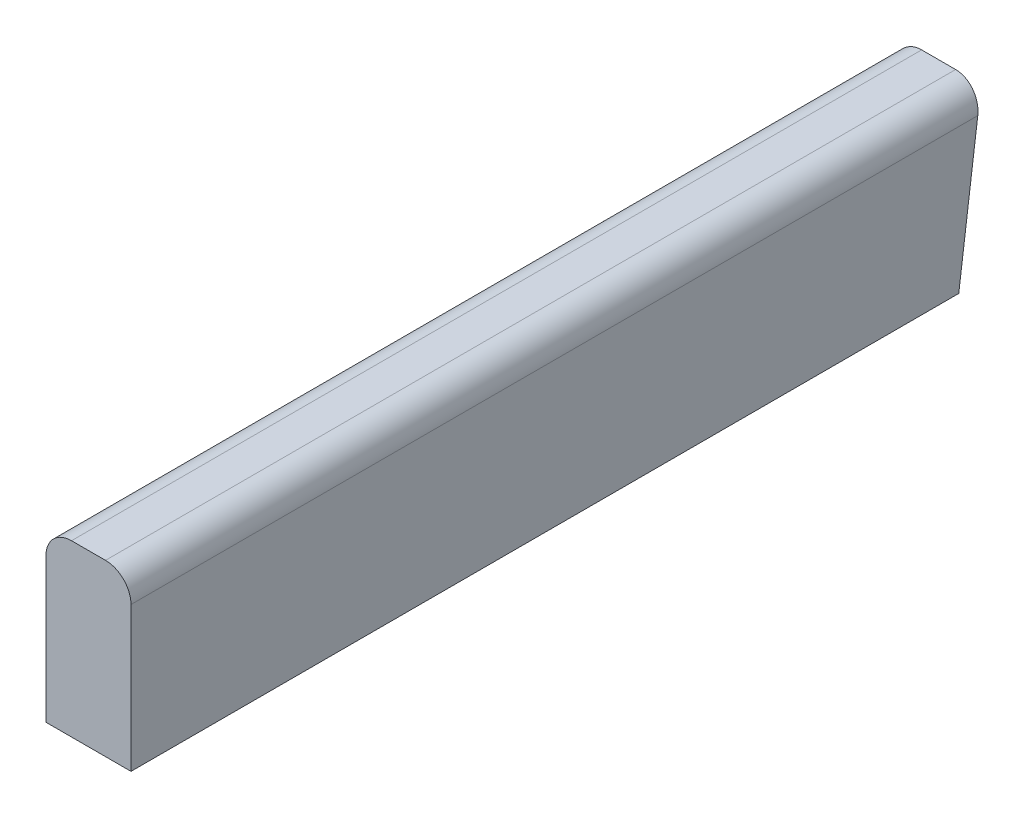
ISO-10303-21;
HEADER;
FILE_DESCRIPTION(('STEP AP214'),'2;1');
FILE_NAME('part.step','',(''),(''),'','','');
FILE_SCHEMA(('AUTOMOTIVE_DESIGN { 1 0 10303 214 1 1 1 1 }'));
ENDSEC;
DATA;
#1=APPLICATION_CONTEXT('core data for automotive mechanical design processes');
#2=APPLICATION_PROTOCOL_DEFINITION('international standard','automotive_design',2000,#1);
#3=PRODUCT_CONTEXT('',#1,'mechanical');
#4=PRODUCT('Part','Part','',(#3));
#5=PRODUCT_RELATED_PRODUCT_CATEGORY('part','',(#4));
#6=PRODUCT_DEFINITION_FORMATION('','',#4);
#7=PRODUCT_DEFINITION_CONTEXT('part definition',#1,'design');
#8=PRODUCT_DEFINITION('design','',#6,#7);
#9=PRODUCT_DEFINITION_SHAPE('','',#8);
#10=(LENGTH_UNIT() NAMED_UNIT(*) SI_UNIT(.MILLI.,.METRE.));
#11=(NAMED_UNIT(*) PLANE_ANGLE_UNIT() SI_UNIT($,.RADIAN.));
#12=(NAMED_UNIT(*) SI_UNIT($,.STERADIAN.) SOLID_ANGLE_UNIT());
#13=UNCERTAINTY_MEASURE_WITH_UNIT(LENGTH_MEASURE(1.E-05),#10,'distance_accuracy_value','');
#14=(GEOMETRIC_REPRESENTATION_CONTEXT(3) GLOBAL_UNCERTAINTY_ASSIGNED_CONTEXT((#13)) GLOBAL_UNIT_ASSIGNED_CONTEXT((#10,
#11,#12)) REPRESENTATION_CONTEXT('',''));
#15=CARTESIAN_POINT('',(0.,0.,0.));
#16=DIRECTION('',(0.,0.,1.));
#17=DIRECTION('',(1.,0.,0.));
#18=AXIS2_PLACEMENT_3D('',#15,#16,#17);
#19=CARTESIAN_POINT('',(0.,0.,100.));
#20=DIRECTION('',(1.,0.,0.));
#21=DIRECTION('',(0.,0.,-1.));
#22=AXIS2_PLACEMENT_3D('',#19,#20,#21);
#23=PLANE('',#22);
#24=DIRECTION('',(0.,0.,-1.));
#25=VECTOR('',#24,1.);
#26=CARTESIAN_POINT('',(0.,17.,100.));
#27=LINE('',#26,#25);
#28=CARTESIAN_POINT('',(0.,17.,100.));
#29=VERTEX_POINT('',#28);
#30=CARTESIAN_POINT('',(0.,17.,0.394957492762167));
#31=VERTEX_POINT('',#30);
#32=EDGE_CURVE('E97',#29,#31,#27,.T.);
#33=ORIENTED_EDGE('',*,*,#32,.T.);
#34=DIRECTION('',(0.,-0.991444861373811,0.130526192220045));
#35=VECTOR('',#34,1.);
#36=CARTESIAN_POINT('',(0.,20.,0.));
#37=LINE('',#36,#35);
#38=CARTESIAN_POINT('',(0.,0.,2.63304995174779));
#39=VERTEX_POINT('',#38);
#40=EDGE_CURVE('E84',#31,#39,#37,.T.);
#41=ORIENTED_EDGE('',*,*,#40,.T.);
#42=DIRECTION('',(0.,0.,-1.));
#43=VECTOR('',#42,1.);
#44=CARTESIAN_POINT('',(0.,0.,100.));
#45=LINE('',#44,#43);
#46=CARTESIAN_POINT('',(0.,0.,100.));
#47=VERTEX_POINT('',#46);
#48=EDGE_CURVE('E11',#47,#39,#45,.T.);
#49=ORIENTED_EDGE('',*,*,#48,.F.);
#50=DIRECTION('',(0.,-1.,0.));
#51=VECTOR('',#50,1.);
#52=CARTESIAN_POINT('',(0.,0.,100.));
#53=LINE('',#52,#51);
#54=EDGE_CURVE('E103',#29,#47,#53,.T.);
#55=ORIENTED_EDGE('',*,*,#54,.F.);
#56=EDGE_LOOP('',(#33,#41,#49,#55));
#57=FACE_BOUND('',#56,.T.);
#58=ADVANCED_FACE('F33',(#57),#23,.F.);
#59=CARTESIAN_POINT('',(0.,0.,100.));
#60=DIRECTION('',(0.,1.,0.));
#61=DIRECTION('',(0.,0.,1.));
#62=AXIS2_PLACEMENT_3D('',#59,#60,#61);
#63=PLANE('',#62);
#64=ORIENTED_EDGE('',*,*,#48,.T.);
#65=DIRECTION('',(1.,0.,0.));
#66=VECTOR('',#65,1.);
#67=CARTESIAN_POINT('',(0.,0.,2.63304995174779));
#68=LINE('',#67,#66);
#69=CARTESIAN_POINT('',(10.,0.,2.63304995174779));
#70=VERTEX_POINT('',#69);
#71=EDGE_CURVE('E80',#39,#70,#68,.T.);
#72=ORIENTED_EDGE('',*,*,#71,.T.);
#73=DIRECTION('',(0.,0.,-1.));
#74=VECTOR('',#73,1.);
#75=CARTESIAN_POINT('',(10.,0.,100.));
#76=LINE('',#75,#74);
#77=CARTESIAN_POINT('',(10.,0.,100.));
#78=VERTEX_POINT('',#77);
#79=EDGE_CURVE('E41',#78,#70,#76,.T.);
#80=ORIENTED_EDGE('',*,*,#79,.F.);
#81=DIRECTION('',(1.,0.,0.));
#82=VECTOR('',#81,1.);
#83=CARTESIAN_POINT('',(0.,0.,100.));
#84=LINE('',#83,#82);
#85=EDGE_CURVE('E100',#47,#78,#84,.T.);
#86=ORIENTED_EDGE('',*,*,#85,.F.);
#87=EDGE_LOOP('',(#64,#72,#80,#86));
#88=FACE_BOUND('',#87,.T.);
#89=ADVANCED_FACE('F99',(#88),#63,.F.);
#90=CARTESIAN_POINT('',(10.,0.,100.));
#91=DIRECTION('',(-1.,0.,0.));
#92=DIRECTION('',(0.,0.,1.));
#93=AXIS2_PLACEMENT_3D('',#90,#91,#92);
#94=PLANE('',#93);
#95=ORIENTED_EDGE('',*,*,#79,.T.);
#96=DIRECTION('',(0.,-0.991444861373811,0.130526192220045));
#97=VECTOR('',#96,1.);
#98=CARTESIAN_POINT('',(10.,20.,0.));
#99=LINE('',#98,#97);
#100=CARTESIAN_POINT('',(10.,17.,0.394957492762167));
#101=VERTEX_POINT('',#100);
#102=EDGE_CURVE('E87',#101,#70,#99,.T.);
#103=ORIENTED_EDGE('',*,*,#102,.F.);
#104=DIRECTION('',(0.,0.,-1.));
#105=VECTOR('',#104,1.);
#106=CARTESIAN_POINT('',(10.,17.,100.));
#107=LINE('',#106,#105);
#108=CARTESIAN_POINT('',(10.,17.,100.));
#109=VERTEX_POINT('',#108);
#110=EDGE_CURVE('E127',#109,#101,#107,.T.);
#111=ORIENTED_EDGE('',*,*,#110,.F.);
#112=DIRECTION('',(0.,1.,0.));
#113=VECTOR('',#112,1.);
#114=CARTESIAN_POINT('',(10.,0.,100.));
#115=LINE('',#114,#113);
#116=EDGE_CURVE('E102',#78,#109,#115,.T.);
#117=ORIENTED_EDGE('',*,*,#116,.F.);
#118=EDGE_LOOP('',(#95,#103,#111,#117));
#119=FACE_BOUND('',#118,.T.);
#120=ADVANCED_FACE('F130',(#119),#94,.F.);
#121=CARTESIAN_POINT('',(7.,17.,100.));
#122=DIRECTION('',(0.,0.,-1.));
#123=DIRECTION('',(-1.,0.,0.));
#124=AXIS2_PLACEMENT_3D('',#121,#122,#123);
#125=CYLINDRICAL_SURFACE('',#124,3.);
#126=ORIENTED_EDGE('',*,*,#110,.T.);
#127=CARTESIAN_POINT('',(7.,17.,0.39495749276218));
#128=DIRECTION('',(0.,0.130526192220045,0.991444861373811));
#129=DIRECTION('',(0.,0.991444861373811,-0.130526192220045));
#130=AXIS2_PLACEMENT_3D('',#127,#128,#129);
#131=ELLIPSE('',#130,3.02588688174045,3.);
#132=CARTESIAN_POINT('',(6.99999999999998,20.,0.));
#133=VERTEX_POINT('',#132);
#134=EDGE_CURVE('E109',#101,#133,#131,.T.);
#135=ORIENTED_EDGE('',*,*,#134,.T.);
#136=DIRECTION('',(0.,0.,-1.));
#137=VECTOR('',#136,1.);
#138=CARTESIAN_POINT('',(6.99999999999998,20.,100.));
#139=LINE('',#138,#137);
#140=CARTESIAN_POINT('',(6.99999999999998,20.,100.));
#141=VERTEX_POINT('',#140);
#142=EDGE_CURVE('E124',#141,#133,#139,.T.);
#143=ORIENTED_EDGE('',*,*,#142,.F.);
#144=CARTESIAN_POINT('',(7.,17.,100.));
#145=DIRECTION('',(0.,0.,1.));
#146=DIRECTION('',(1.,0.,0.));
#147=AXIS2_PLACEMENT_3D('',#144,#145,#146);
#148=CIRCLE('',#147,3.);
#149=EDGE_CURVE('E115',#109,#141,#148,.T.);
#150=ORIENTED_EDGE('',*,*,#149,.F.);
#151=EDGE_LOOP('',(#126,#135,#143,#150));
#152=FACE_BOUND('',#151,.T.);
#153=ADVANCED_FACE('F138',(#152),#125,.T.);
#154=CARTESIAN_POINT('',(3.00000000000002,20.,100.));
#155=DIRECTION('',(0.,-1.,0.));
#156=DIRECTION('',(0.,0.,-1.));
#157=AXIS2_PLACEMENT_3D('',#154,#155,#156);
#158=PLANE('',#157);
#159=DIRECTION('',(-1.,0.,0.));
#160=VECTOR('',#159,1.);
#161=CARTESIAN_POINT('',(3.00000000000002,20.,0.));
#162=LINE('',#161,#160);
#163=CARTESIAN_POINT('',(3.00000000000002,20.,0.));
#164=VERTEX_POINT('',#163);
#165=EDGE_CURVE('E106',#133,#164,#162,.T.);
#166=ORIENTED_EDGE('',*,*,#165,.T.);
#167=DIRECTION('',(0.,0.,-1.));
#168=VECTOR('',#167,1.);
#169=CARTESIAN_POINT('',(3.00000000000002,20.,100.));
#170=LINE('',#169,#168);
#171=CARTESIAN_POINT('',(3.00000000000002,20.,100.));
#172=VERTEX_POINT('',#171);
#173=EDGE_CURVE('E121',#172,#164,#170,.T.);
#174=ORIENTED_EDGE('',*,*,#173,.F.);
#175=DIRECTION('',(-1.,0.,0.));
#176=VECTOR('',#175,1.);
#177=CARTESIAN_POINT('',(3.00000000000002,20.,100.));
#178=LINE('',#177,#176);
#179=EDGE_CURVE('E117',#141,#172,#178,.T.);
#180=ORIENTED_EDGE('',*,*,#179,.F.);
#181=ORIENTED_EDGE('',*,*,#142,.T.);
#182=EDGE_LOOP('',(#166,#174,#180,#181));
#183=FACE_BOUND('',#182,.T.);
#184=ADVANCED_FACE('F140',(#183),#158,.F.);
#185=CARTESIAN_POINT('',(3.,17.,100.));
#186=DIRECTION('',(0.,0.,-1.));
#187=DIRECTION('',(-1.,0.,0.));
#188=AXIS2_PLACEMENT_3D('',#185,#186,#187);
#189=CYLINDRICAL_SURFACE('',#188,3.);
#190=ORIENTED_EDGE('',*,*,#173,.T.);
#191=CARTESIAN_POINT('',(3.,17.,0.39495749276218));
#192=DIRECTION('',(0.,0.130526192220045,0.991444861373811));
#193=DIRECTION('',(0.,0.991444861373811,-0.130526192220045));
#194=AXIS2_PLACEMENT_3D('',#191,#192,#193);
#195=ELLIPSE('',#194,3.02588688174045,3.);
#196=EDGE_CURVE('E91',#164,#31,#195,.T.);
#197=ORIENTED_EDGE('',*,*,#196,.T.);
#198=ORIENTED_EDGE('',*,*,#32,.F.);
#199=CARTESIAN_POINT('',(3.,17.,100.));
#200=DIRECTION('',(0.,0.,1.));
#201=DIRECTION('',(-1.,0.,0.));
#202=AXIS2_PLACEMENT_3D('',#199,#200,#201);
#203=CIRCLE('',#202,3.);
#204=EDGE_CURVE('E48',#172,#29,#203,.T.);
#205=ORIENTED_EDGE('',*,*,#204,.F.);
#206=EDGE_LOOP('',(#190,#197,#198,#205));
#207=FACE_BOUND('',#206,.T.);
#208=ADVANCED_FACE('F142',(#207),#189,.T.);
#209=CARTESIAN_POINT('',(3.,17.,100.));
#210=DIRECTION('',(0.,0.,-1.));
#211=DIRECTION('',(-1.,0.,0.));
#212=AXIS2_PLACEMENT_3D('',#209,#210,#211);
#213=PLANE('',#212);
#214=ORIENTED_EDGE('',*,*,#54,.T.);
#215=ORIENTED_EDGE('',*,*,#85,.T.);
#216=ORIENTED_EDGE('',*,*,#116,.T.);
#217=ORIENTED_EDGE('',*,*,#149,.T.);
#218=ORIENTED_EDGE('',*,*,#179,.T.);
#219=ORIENTED_EDGE('',*,*,#204,.T.);
#220=EDGE_LOOP('',(#214,#215,#216,#217,#218,#219));
#221=FACE_BOUND('',#220,.T.);
#222=ADVANCED_FACE('F105',(#221),#213,.F.);
#223=CARTESIAN_POINT('',(0.,20.,0.));
#224=DIRECTION('',(0.,0.130526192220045,0.991444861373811));
#225=DIRECTION('',(0.,-0.991444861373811,0.130526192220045));
#226=AXIS2_PLACEMENT_3D('',#223,#224,#225);
#227=PLANE('',#226);
#228=ORIENTED_EDGE('',*,*,#102,.T.);
#229=ORIENTED_EDGE('',*,*,#71,.F.);
#230=ORIENTED_EDGE('',*,*,#40,.F.);
#231=ORIENTED_EDGE('',*,*,#196,.F.);
#232=ORIENTED_EDGE('',*,*,#165,.F.);
#233=ORIENTED_EDGE('',*,*,#134,.F.);
#234=EDGE_LOOP('',(#228,#229,#230,#231,#232,#233));
#235=FACE_BOUND('',#234,.T.);
#236=ADVANCED_FACE('F82',(#235),#227,.F.);
#237=CLOSED_SHELL('',(#58,#89,#120,#153,#184,#208,#222,#236));
#238=MANIFOLD_SOLID_BREP('B2',#237);
#239=ADVANCED_BREP_SHAPE_REPRESENTATION('',(#18,#238),#14);
#240=SHAPE_DEFINITION_REPRESENTATION(#9,#239);
ENDSEC;
END-ISO-10303-21;
